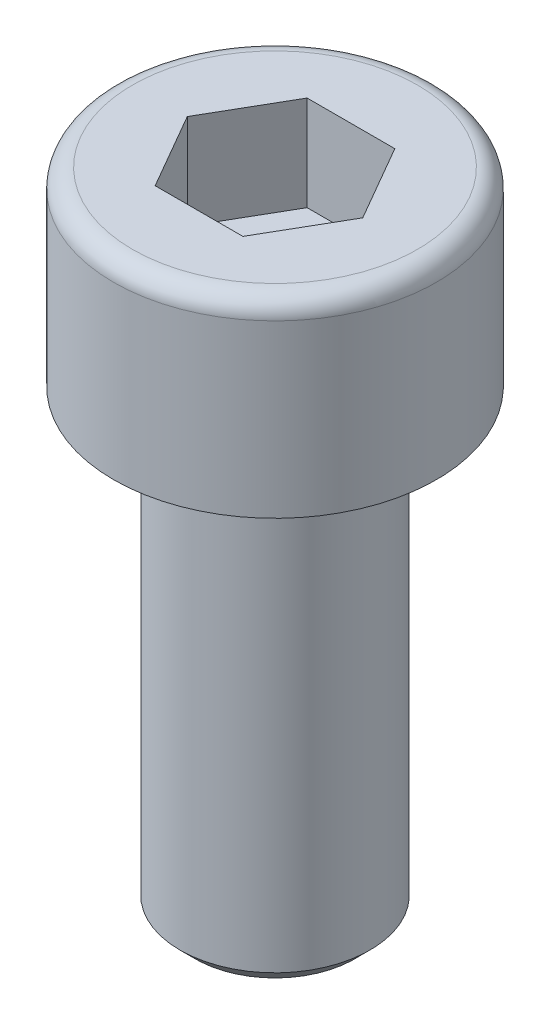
ISO-10303-21;
HEADER;
FILE_DESCRIPTION(('STEP AP214'),'2;1');
FILE_NAME('part.step','',(''),(''),'','','');
FILE_SCHEMA(('AUTOMOTIVE_DESIGN { 1 0 10303 214 1 1 1 1 }'));
ENDSEC;
DATA;
#1=APPLICATION_CONTEXT('core data for automotive mechanical design processes');
#2=APPLICATION_PROTOCOL_DEFINITION('international standard','automotive_design',2000,#1);
#3=PRODUCT_CONTEXT('',#1,'mechanical');
#4=PRODUCT('Part','Part','',(#3));
#5=PRODUCT_RELATED_PRODUCT_CATEGORY('part','',(#4));
#6=PRODUCT_DEFINITION_FORMATION('','',#4);
#7=PRODUCT_DEFINITION_CONTEXT('part definition',#1,'design');
#8=PRODUCT_DEFINITION('design','',#6,#7);
#9=PRODUCT_DEFINITION_SHAPE('','',#8);
#10=(LENGTH_UNIT() NAMED_UNIT(*) SI_UNIT(.MILLI.,.METRE.));
#11=(NAMED_UNIT(*) PLANE_ANGLE_UNIT() SI_UNIT($,.RADIAN.));
#12=(NAMED_UNIT(*) SI_UNIT($,.STERADIAN.) SOLID_ANGLE_UNIT());
#13=UNCERTAINTY_MEASURE_WITH_UNIT(LENGTH_MEASURE(1.E-05),#10,'distance_accuracy_value','');
#14=(GEOMETRIC_REPRESENTATION_CONTEXT(3) GLOBAL_UNCERTAINTY_ASSIGNED_CONTEXT((#13)) GLOBAL_UNIT_ASSIGNED_CONTEXT((#10,
#11,#12)) REPRESENTATION_CONTEXT('',''));
#15=CARTESIAN_POINT('',(0.,0.,0.));
#16=DIRECTION('',(0.,0.,1.));
#17=DIRECTION('',(1.,0.,0.));
#18=AXIS2_PLACEMENT_3D('',#15,#16,#17);
#19=CARTESIAN_POINT('',(-2.50000000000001,0.,0.));
#20=DIRECTION('',(0.,-1.,0.));
#21=DIRECTION('',(0.,0.,-1.));
#22=AXIS2_PLACEMENT_3D('',#19,#20,#21);
#23=PLANE('',#22);
#24=CARTESIAN_POINT('',(0.,0.,0.));
#25=DIRECTION('',(0.,-1.,0.));
#26=DIRECTION('',(0.,0.,-1.));
#27=AXIS2_PLACEMENT_3D('',#24,#25,#26);
#28=CIRCLE('',#27,2.1);
#29=CARTESIAN_POINT('',(0.,0.,-2.1));
#30=VERTEX_POINT('',#29);
#31=EDGE_CURVE('E11',#30,#30,#28,.T.);
#32=ORIENTED_EDGE('',*,*,#31,.T.);
#33=EDGE_LOOP('',(#32));
#34=FACE_BOUND('',#33,.T.);
#35=ADVANCED_FACE('F28',(#34),#23,.T.);
#36=CARTESIAN_POINT('',(0.,50.,0.));
#37=DIRECTION('',(0.,1.,0.));
#38=DIRECTION('',(0.,0.,1.));
#39=AXIS2_PLACEMENT_3D('',#36,#37,#38);
#40=CYLINDRICAL_SURFACE('',#39,2.5);
#41=CARTESIAN_POINT('',(0.,0.400000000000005,0.));
#42=DIRECTION('',(0.,-1.,0.));
#43=DIRECTION('',(0.,0.,-1.));
#44=AXIS2_PLACEMENT_3D('',#41,#42,#43);
#45=CIRCLE('',#44,2.5);
#46=CARTESIAN_POINT('',(0.,0.400000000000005,-2.5));
#47=VERTEX_POINT('',#46);
#48=EDGE_CURVE('E35',#47,#47,#45,.F.);
#49=ORIENTED_EDGE('',*,*,#48,.T.);
#50=EDGE_LOOP('',(#49));
#51=FACE_BOUND('',#50,.T.);
#52=CARTESIAN_POINT('',(0.,12.,0.));
#53=DIRECTION('',(0.,1.,0.));
#54=DIRECTION('',(0.,0.,1.));
#55=AXIS2_PLACEMENT_3D('',#52,#53,#54);
#56=CIRCLE('',#55,2.5);
#57=CARTESIAN_POINT('',(0.,12.,2.5));
#58=VERTEX_POINT('',#57);
#59=EDGE_CURVE('E145',#58,#58,#56,.T.);
#60=ORIENTED_EDGE('',*,*,#59,.F.);
#61=EDGE_LOOP('',(#60));
#62=FACE_BOUND('',#61,.T.);
#63=ADVANCED_FACE('F150',(#51,#62),#40,.T.);
#64=CARTESIAN_POINT('',(-4.25,12.,0.));
#65=DIRECTION('',(0.,-1.,0.));
#66=DIRECTION('',(0.,0.,-1.));
#67=AXIS2_PLACEMENT_3D('',#64,#65,#66);
#68=PLANE('',#67);
#69=ORIENTED_EDGE('',*,*,#59,.T.);
#70=EDGE_LOOP('',(#69));
#71=FACE_BOUND('',#70,.T.);
#72=CARTESIAN_POINT('',(0.,12.,0.));
#73=DIRECTION('',(0.,1.,0.));
#74=DIRECTION('',(0.,0.,1.));
#75=AXIS2_PLACEMENT_3D('',#72,#73,#74);
#76=CIRCLE('',#75,4.25);
#77=CARTESIAN_POINT('',(0.,12.,4.25));
#78=VERTEX_POINT('',#77);
#79=EDGE_CURVE('E142',#78,#78,#76,.T.);
#80=ORIENTED_EDGE('',*,*,#79,.F.);
#81=EDGE_LOOP('',(#80));
#82=FACE_BOUND('',#81,.T.);
#83=ADVANCED_FACE('F169',(#71,#82),#68,.T.);
#84=CARTESIAN_POINT('',(0.,50.,0.));
#85=DIRECTION('',(0.,1.,0.));
#86=DIRECTION('',(0.,0.,1.));
#87=AXIS2_PLACEMENT_3D('',#84,#85,#86);
#88=CYLINDRICAL_SURFACE('',#87,4.24999999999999);
#89=ORIENTED_EDGE('',*,*,#79,.T.);
#90=EDGE_LOOP('',(#89));
#91=FACE_BOUND('',#90,.T.);
#92=CARTESIAN_POINT('',(0.,16.5,0.));
#93=DIRECTION('',(0.,1.,0.));
#94=DIRECTION('',(0.,0.,1.));
#95=AXIS2_PLACEMENT_3D('',#92,#93,#94);
#96=CIRCLE('',#95,4.24999999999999);
#97=CARTESIAN_POINT('',(0.,16.5,4.24999999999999));
#98=VERTEX_POINT('',#97);
#99=EDGE_CURVE('E139',#98,#98,#96,.T.);
#100=ORIENTED_EDGE('',*,*,#99,.F.);
#101=EDGE_LOOP('',(#100));
#102=FACE_BOUND('',#101,.T.);
#103=ADVANCED_FACE('F173',(#91,#102),#88,.T.);
#104=CARTESIAN_POINT('',(0.,16.5,0.));
#105=DIRECTION('',(0.,1.,0.));
#106=DIRECTION('',(0.,0.,1.));
#107=AXIS2_PLACEMENT_3D('',#104,#105,#106);
#108=TOROIDAL_SURFACE('',#107,3.75,0.499999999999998);
#109=CARTESIAN_POINT('',(0.,17.,0.));
#110=DIRECTION('',(0.,1.,0.));
#111=DIRECTION('',(0.,0.,1.));
#112=AXIS2_PLACEMENT_3D('',#109,#110,#111);
#113=CIRCLE('',#112,3.75);
#114=CARTESIAN_POINT('',(0.,17.,3.75));
#115=VERTEX_POINT('',#114);
#116=EDGE_CURVE('E130',#115,#115,#113,.T.);
#117=ORIENTED_EDGE('',*,*,#116,.F.);
#118=EDGE_LOOP('',(#117));
#119=FACE_BOUND('',#118,.T.);
#120=ORIENTED_EDGE('',*,*,#99,.T.);
#121=EDGE_LOOP('',(#120));
#122=FACE_BOUND('',#121,.T.);
#123=ADVANCED_FACE('F179',(#119,#122),#108,.T.);
#124=CARTESIAN_POINT('',(0.,17.,0.));
#125=DIRECTION('',(0.,1.,0.));
#126=DIRECTION('',(0.,0.,1.));
#127=AXIS2_PLACEMENT_3D('',#124,#125,#126);
#128=PLANE('',#127);
#129=DIRECTION('',(0.5,0.,0.866025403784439));
#130=VECTOR('',#129,1.);
#131=CARTESIAN_POINT('',(-2.3094010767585,17.,0.));
#132=LINE('',#131,#130);
#133=CARTESIAN_POINT('',(-2.3094010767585,17.,0.));
#134=VERTEX_POINT('',#133);
#135=CARTESIAN_POINT('',(-1.15470053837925,17.,2.));
#136=VERTEX_POINT('',#135);
#137=EDGE_CURVE('E42',#134,#136,#132,.T.);
#138=ORIENTED_EDGE('',*,*,#137,.F.);
#139=DIRECTION('',(-0.5,0.,0.866025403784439));
#140=VECTOR('',#139,1.);
#141=CARTESIAN_POINT('',(-1.15470053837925,17.,-2.));
#142=LINE('',#141,#140);
#143=CARTESIAN_POINT('',(-1.15470053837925,17.,-2.));
#144=VERTEX_POINT('',#143);
#145=EDGE_CURVE('E112',#144,#134,#142,.T.);
#146=ORIENTED_EDGE('',*,*,#145,.F.);
#147=DIRECTION('',(-1.,0.,0.));
#148=VECTOR('',#147,1.);
#149=CARTESIAN_POINT('',(1.15470053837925,17.,-2.));
#150=LINE('',#149,#148);
#151=CARTESIAN_POINT('',(1.15470053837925,17.,-2.));
#152=VERTEX_POINT('',#151);
#153=EDGE_CURVE('E106',#152,#144,#150,.T.);
#154=ORIENTED_EDGE('',*,*,#153,.F.);
#155=DIRECTION('',(-0.5,0.,-0.866025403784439));
#156=VECTOR('',#155,1.);
#157=CARTESIAN_POINT('',(2.3094010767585,17.,0.));
#158=LINE('',#157,#156);
#159=CARTESIAN_POINT('',(2.3094010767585,17.,0.));
#160=VERTEX_POINT('',#159);
#161=EDGE_CURVE('E104',#160,#152,#158,.T.);
#162=ORIENTED_EDGE('',*,*,#161,.F.);
#163=DIRECTION('',(0.5,0.,-0.866025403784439));
#164=VECTOR('',#163,1.);
#165=CARTESIAN_POINT('',(1.15470053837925,17.,2.));
#166=LINE('',#165,#164);
#167=CARTESIAN_POINT('',(1.15470053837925,17.,2.));
#168=VERTEX_POINT('',#167);
#169=EDGE_CURVE('E85',#168,#160,#166,.T.);
#170=ORIENTED_EDGE('',*,*,#169,.F.);
#171=DIRECTION('',(1.,0.,0.));
#172=VECTOR('',#171,1.);
#173=CARTESIAN_POINT('',(-1.15470053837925,17.,2.));
#174=LINE('',#173,#172);
#175=EDGE_CURVE('E96',#136,#168,#174,.T.);
#176=ORIENTED_EDGE('',*,*,#175,.F.);
#177=EDGE_LOOP('',(#138,#146,#154,#162,#170,#176));
#178=FACE_BOUND('',#177,.T.);
#179=ORIENTED_EDGE('',*,*,#116,.T.);
#180=EDGE_LOOP('',(#179));
#181=FACE_BOUND('',#180,.T.);
#182=ADVANCED_FACE('F100',(#178,#181),#128,.T.);
#183=CARTESIAN_POINT('',(-2.3094010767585,14.5,0.));
#184=DIRECTION('',(-0.866025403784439,0.,0.5));
#185=DIRECTION('',(0.5,0.,0.866025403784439));
#186=AXIS2_PLACEMENT_3D('',#183,#184,#185);
#187=PLANE('',#186);
#188=ORIENTED_EDGE('',*,*,#137,.T.);
#189=DIRECTION('',(0.,1.,0.));
#190=VECTOR('',#189,1.);
#191=CARTESIAN_POINT('',(-1.15470053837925,14.5,2.));
#192=LINE('',#191,#190);
#193=CARTESIAN_POINT('',(-1.15470053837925,14.5,2.));
#194=VERTEX_POINT('',#193);
#195=EDGE_CURVE('E93',#194,#136,#192,.T.);
#196=ORIENTED_EDGE('',*,*,#195,.F.);
#197=DIRECTION('',(0.5,0.,0.866025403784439));
#198=VECTOR('',#197,1.);
#199=CARTESIAN_POINT('',(-2.3094010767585,14.5,0.));
#200=LINE('',#199,#198);
#201=CARTESIAN_POINT('',(-2.3094010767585,14.5,0.));
#202=VERTEX_POINT('',#201);
#203=EDGE_CURVE('E114',#202,#194,#200,.T.);
#204=ORIENTED_EDGE('',*,*,#203,.F.);
#205=DIRECTION('',(0.,1.,0.));
#206=VECTOR('',#205,1.);
#207=CARTESIAN_POINT('',(-2.3094010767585,14.5,0.));
#208=LINE('',#207,#206);
#209=EDGE_CURVE('E49',#202,#134,#208,.T.);
#210=ORIENTED_EDGE('',*,*,#209,.T.);
#211=EDGE_LOOP('',(#188,#196,#204,#210));
#212=FACE_BOUND('',#211,.T.);
#213=ADVANCED_FACE('F186',(#212),#187,.F.);
#214=CARTESIAN_POINT('',(-1.15470053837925,14.5,-2.));
#215=DIRECTION('',(-0.866025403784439,0.,-0.5));
#216=DIRECTION('',(-0.5,0.,0.866025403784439));
#217=AXIS2_PLACEMENT_3D('',#214,#215,#216);
#218=PLANE('',#217);
#219=ORIENTED_EDGE('',*,*,#145,.T.);
#220=ORIENTED_EDGE('',*,*,#209,.F.);
#221=DIRECTION('',(-0.5,0.,0.866025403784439));
#222=VECTOR('',#221,1.);
#223=CARTESIAN_POINT('',(-1.15470053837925,14.5,-2.));
#224=LINE('',#223,#222);
#225=CARTESIAN_POINT('',(-1.15470053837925,14.5,-2.));
#226=VERTEX_POINT('',#225);
#227=EDGE_CURVE('E126',#226,#202,#224,.T.);
#228=ORIENTED_EDGE('',*,*,#227,.F.);
#229=DIRECTION('',(0.,1.,0.));
#230=VECTOR('',#229,1.);
#231=CARTESIAN_POINT('',(-1.15470053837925,14.5,-2.));
#232=LINE('',#231,#230);
#233=EDGE_CURVE('E131',#226,#144,#232,.T.);
#234=ORIENTED_EDGE('',*,*,#233,.T.);
#235=EDGE_LOOP('',(#219,#220,#228,#234));
#236=FACE_BOUND('',#235,.T.);
#237=ADVANCED_FACE('F189',(#236),#218,.F.);
#238=CARTESIAN_POINT('',(1.15470053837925,14.5,-2.));
#239=DIRECTION('',(0.,0.,-1.));
#240=DIRECTION('',(-1.,0.,0.));
#241=AXIS2_PLACEMENT_3D('',#238,#239,#240);
#242=PLANE('',#241);
#243=ORIENTED_EDGE('',*,*,#153,.T.);
#244=ORIENTED_EDGE('',*,*,#233,.F.);
#245=DIRECTION('',(-1.,0.,0.));
#246=VECTOR('',#245,1.);
#247=CARTESIAN_POINT('',(1.15470053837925,14.5,-2.));
#248=LINE('',#247,#246);
#249=CARTESIAN_POINT('',(1.15470053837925,14.5,-2.));
#250=VERTEX_POINT('',#249);
#251=EDGE_CURVE('E123',#250,#226,#248,.T.);
#252=ORIENTED_EDGE('',*,*,#251,.F.);
#253=DIRECTION('',(0.,1.,0.));
#254=VECTOR('',#253,1.);
#255=CARTESIAN_POINT('',(1.15470053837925,14.5,-2.));
#256=LINE('',#255,#254);
#257=EDGE_CURVE('E133',#250,#152,#256,.T.);
#258=ORIENTED_EDGE('',*,*,#257,.T.);
#259=EDGE_LOOP('',(#243,#244,#252,#258));
#260=FACE_BOUND('',#259,.T.);
#261=ADVANCED_FACE('F197',(#260),#242,.F.);
#262=CARTESIAN_POINT('',(2.3094010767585,14.5,0.));
#263=DIRECTION('',(0.866025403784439,0.,-0.5));
#264=DIRECTION('',(-0.5,0.,-0.866025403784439));
#265=AXIS2_PLACEMENT_3D('',#262,#263,#264);
#266=PLANE('',#265);
#267=ORIENTED_EDGE('',*,*,#161,.T.);
#268=ORIENTED_EDGE('',*,*,#257,.F.);
#269=DIRECTION('',(-0.5,0.,-0.866025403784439));
#270=VECTOR('',#269,1.);
#271=CARTESIAN_POINT('',(2.3094010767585,14.5,0.));
#272=LINE('',#271,#270);
#273=CARTESIAN_POINT('',(2.3094010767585,14.5,0.));
#274=VERTEX_POINT('',#273);
#275=EDGE_CURVE('E120',#274,#250,#272,.T.);
#276=ORIENTED_EDGE('',*,*,#275,.F.);
#277=DIRECTION('',(0.,1.,0.));
#278=VECTOR('',#277,1.);
#279=CARTESIAN_POINT('',(2.3094010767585,14.5,0.));
#280=LINE('',#279,#278);
#281=EDGE_CURVE('E92',#274,#160,#280,.T.);
#282=ORIENTED_EDGE('',*,*,#281,.T.);
#283=EDGE_LOOP('',(#267,#268,#276,#282));
#284=FACE_BOUND('',#283,.T.);
#285=ADVANCED_FACE('F194',(#284),#266,.F.);
#286=CARTESIAN_POINT('',(1.15470053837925,14.5,2.));
#287=DIRECTION('',(0.866025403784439,0.,0.5));
#288=DIRECTION('',(0.5,0.,-0.866025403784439));
#289=AXIS2_PLACEMENT_3D('',#286,#287,#288);
#290=PLANE('',#289);
#291=ORIENTED_EDGE('',*,*,#169,.T.);
#292=ORIENTED_EDGE('',*,*,#281,.F.);
#293=DIRECTION('',(0.5,0.,-0.866025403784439));
#294=VECTOR('',#293,1.);
#295=CARTESIAN_POINT('',(1.15470053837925,14.5,2.));
#296=LINE('',#295,#294);
#297=CARTESIAN_POINT('',(1.15470053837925,14.5,2.));
#298=VERTEX_POINT('',#297);
#299=EDGE_CURVE('E88',#298,#274,#296,.T.);
#300=ORIENTED_EDGE('',*,*,#299,.F.);
#301=DIRECTION('',(0.,1.,0.));
#302=VECTOR('',#301,1.);
#303=CARTESIAN_POINT('',(1.15470053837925,14.5,2.));
#304=LINE('',#303,#302);
#305=EDGE_CURVE('E81',#298,#168,#304,.T.);
#306=ORIENTED_EDGE('',*,*,#305,.T.);
#307=EDGE_LOOP('',(#291,#292,#300,#306));
#308=FACE_BOUND('',#307,.T.);
#309=ADVANCED_FACE('F83',(#308),#290,.F.);
#310=CARTESIAN_POINT('',(-1.15470053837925,14.5,2.));
#311=DIRECTION('',(0.,0.,1.));
#312=DIRECTION('',(1.,0.,0.));
#313=AXIS2_PLACEMENT_3D('',#310,#311,#312);
#314=PLANE('',#313);
#315=ORIENTED_EDGE('',*,*,#175,.T.);
#316=ORIENTED_EDGE('',*,*,#305,.F.);
#317=DIRECTION('',(1.,0.,0.));
#318=VECTOR('',#317,1.);
#319=CARTESIAN_POINT('',(-1.15470053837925,14.5,2.));
#320=LINE('',#319,#318);
#321=EDGE_CURVE('E117',#194,#298,#320,.T.);
#322=ORIENTED_EDGE('',*,*,#321,.F.);
#323=ORIENTED_EDGE('',*,*,#195,.T.);
#324=EDGE_LOOP('',(#315,#316,#322,#323));
#325=FACE_BOUND('',#324,.T.);
#326=ADVANCED_FACE('F97',(#325),#314,.F.);
#327=CARTESIAN_POINT('',(-2.3094010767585,14.5,0.));
#328=DIRECTION('',(0.,-1.,0.));
#329=DIRECTION('',(0.,0.,-1.));
#330=AXIS2_PLACEMENT_3D('',#327,#328,#329);
#331=PLANE('',#330);
#332=ORIENTED_EDGE('',*,*,#203,.T.);
#333=ORIENTED_EDGE('',*,*,#321,.T.);
#334=ORIENTED_EDGE('',*,*,#299,.T.);
#335=ORIENTED_EDGE('',*,*,#275,.T.);
#336=ORIENTED_EDGE('',*,*,#251,.T.);
#337=ORIENTED_EDGE('',*,*,#227,.T.);
#338=EDGE_LOOP('',(#332,#333,#334,#335,#336,#337));
#339=FACE_BOUND('',#338,.T.);
#340=ADVANCED_FACE('F155',(#339),#331,.F.);
#341=CARTESIAN_POINT('',(0.,0.400000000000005,0.));
#342=DIRECTION('',(0.,1.,0.));
#343=DIRECTION('',(0.,0.,1.));
#344=AXIS2_PLACEMENT_3D('',#341,#342,#343);
#345=CONICAL_SURFACE('',#344,2.5,0.785398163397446);
#346=ORIENTED_EDGE('',*,*,#31,.F.);
#347=EDGE_LOOP('',(#346));
#348=FACE_BOUND('',#347,.T.);
#349=ORIENTED_EDGE('',*,*,#48,.F.);
#350=EDGE_LOOP('',(#349));
#351=FACE_BOUND('',#350,.T.);
#352=ADVANCED_FACE('F153',(#348,#351),#345,.T.);
#353=CLOSED_SHELL('',(#35,#63,#83,#103,#123,#182,#213,#237,#261,#285,#309,#326,#340,#352));
#354=MANIFOLD_SOLID_BREP('B2',#353);
#355=ADVANCED_BREP_SHAPE_REPRESENTATION('',(#18,#354),#14);
#356=SHAPE_DEFINITION_REPRESENTATION(#9,#355);
ENDSEC;
END-ISO-10303-21;
